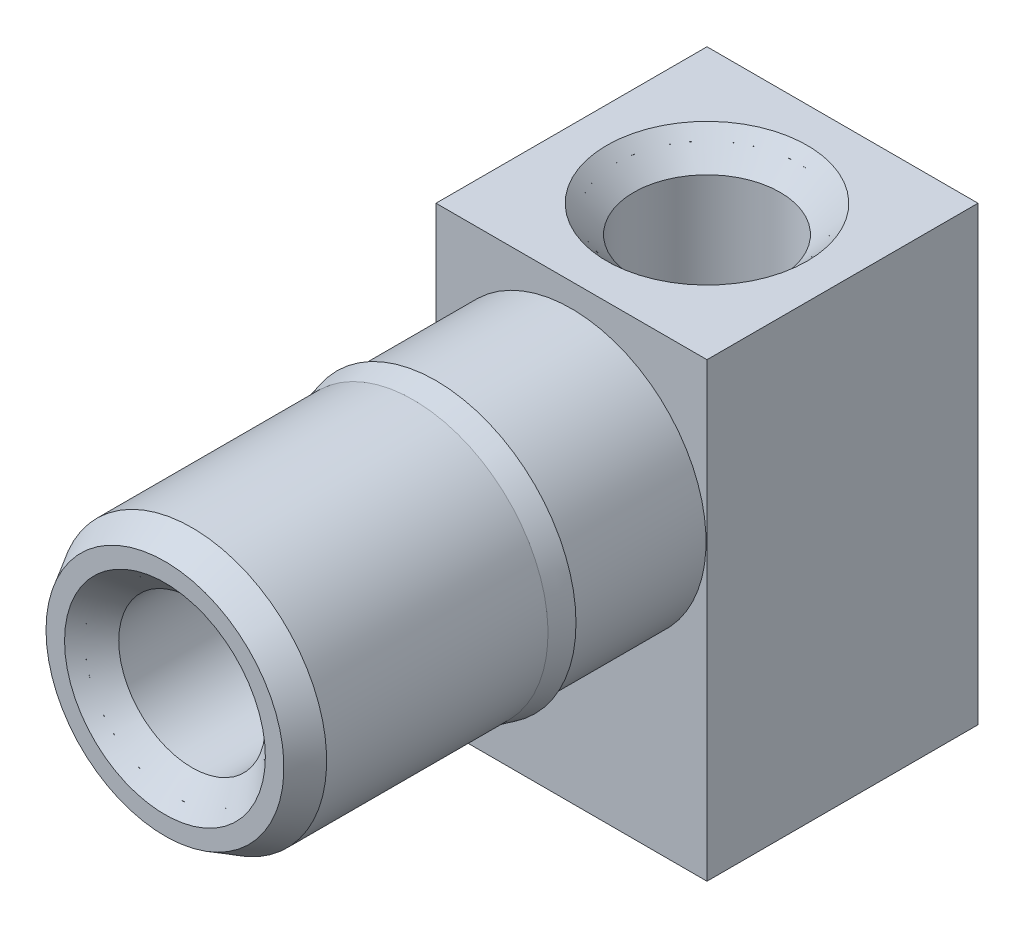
ISO-10303-21;
HEADER;
FILE_DESCRIPTION(('STEP AP214'),'2;1');
FILE_NAME('part.step','',(''),(''),'','','');
FILE_SCHEMA(('AUTOMOTIVE_DESIGN { 1 0 10303 214 1 1 1 1 }'));
ENDSEC;
DATA;
#1=APPLICATION_CONTEXT('core data for automotive mechanical design processes');
#2=APPLICATION_PROTOCOL_DEFINITION('international standard','automotive_design',2000,#1);
#3=PRODUCT_CONTEXT('',#1,'mechanical');
#4=PRODUCT('Part','Part','',(#3));
#5=PRODUCT_RELATED_PRODUCT_CATEGORY('part','',(#4));
#6=PRODUCT_DEFINITION_FORMATION('','',#4);
#7=PRODUCT_DEFINITION_CONTEXT('part definition',#1,'design');
#8=PRODUCT_DEFINITION('design','',#6,#7);
#9=PRODUCT_DEFINITION_SHAPE('','',#8);
#10=(LENGTH_UNIT() NAMED_UNIT(*) SI_UNIT(.MILLI.,.METRE.));
#11=(NAMED_UNIT(*) PLANE_ANGLE_UNIT() SI_UNIT($,.RADIAN.));
#12=(NAMED_UNIT(*) SI_UNIT($,.STERADIAN.) SOLID_ANGLE_UNIT());
#13=UNCERTAINTY_MEASURE_WITH_UNIT(LENGTH_MEASURE(1.E-05),#10,'distance_accuracy_value','');
#14=(GEOMETRIC_REPRESENTATION_CONTEXT(3) GLOBAL_UNCERTAINTY_ASSIGNED_CONTEXT((#13)) GLOBAL_UNIT_ASSIGNED_CONTEXT((#10,
#11,#12)) REPRESENTATION_CONTEXT('',''));
#15=CARTESIAN_POINT('',(0.,0.,0.));
#16=DIRECTION('',(0.,0.,1.));
#17=DIRECTION('',(1.,0.,0.));
#18=AXIS2_PLACEMENT_3D('',#15,#16,#17);
#19=CARTESIAN_POINT('',(0.,0.,0.100000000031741));
#20=DIRECTION('',(0.,0.,1.));
#21=DIRECTION('',(1.,0.,0.));
#22=AXIS2_PLACEMENT_3D('',#19,#20,#21);
#23=CONICAL_SURFACE('',#22,0.811499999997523,1.02974425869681);
#24=CARTESIAN_POINT('',(0.,5.6843418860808E-11,-0.387598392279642));
#25=VERTEX_POINT('',#24);
#26=VERTEX_LOOP('',#25);
#27=FACE_BOUND('',#26,.T.);
#28=CARTESIAN_POINT('',(0.,0.,0.1));
#29=DIRECTION('',(0.,0.,-1.));
#30=DIRECTION('',(-1.,0.,0.));
#31=AXIS2_PLACEMENT_3D('',#28,#29,#30);
#32=CIRCLE('',#31,0.8115);
#33=CARTESIAN_POINT('',(-0.8115,0.,0.1));
#34=VERTEX_POINT('',#33);
#35=EDGE_CURVE('P0_E65',#34,#34,#32,.F.);
#36=ORIENTED_EDGE('',*,*,#35,.T.);
#37=EDGE_LOOP('',(#36));
#38=FACE_BOUND('',#37,.T.);
#39=ADVANCED_FACE('P0_F16',(#27,#38),#23,.F.);
#40=CARTESIAN_POINT('',(0.,0.,4.744379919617));
#41=DIRECTION('',(0.,0.,-1.));
#42=DIRECTION('',(-1.,0.,0.));
#43=AXIS2_PLACEMENT_3D('',#40,#41,#42);
#44=CYLINDRICAL_SURFACE('',#43,0.8115);
#45=ORIENTED_EDGE('',*,*,#35,.F.);
#46=EDGE_LOOP('',(#45));
#47=FACE_BOUND('',#46,.T.);
#48=CARTESIAN_POINT('',(0.,0.,4.1999999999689));
#49=DIRECTION('',(0.,0.,1.));
#50=DIRECTION('',(0.,1.,0.));
#51=AXIS2_PLACEMENT_3D('',#48,#49,#50);
#52=CIRCLE('',#51,0.811499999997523);
#53=CARTESIAN_POINT('',(0.,0.811499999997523,4.1999999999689));
#54=VERTEX_POINT('',#53);
#55=EDGE_CURVE('P0_E67',#54,#54,#52,.T.);
#56=ORIENTED_EDGE('',*,*,#55,.T.);
#57=EDGE_LOOP('',(#56));
#58=FACE_BOUND('',#57,.T.);
#59=ADVANCED_FACE('P0_F62',(#47,#58),#44,.F.);
#60=CARTESIAN_POINT('',(0.,0.,4.50000000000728));
#61=DIRECTION('',(0.,0.,1.));
#62=DIRECTION('',(1.,0.,0.));
#63=AXIS2_PLACEMENT_3D('',#60,#61,#62);
#64=CONICAL_SURFACE('',#63,1.1115000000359,0.785398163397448);
#65=ORIENTED_EDGE('',*,*,#55,.F.);
#66=EDGE_LOOP('',(#65));
#67=FACE_BOUND('',#66,.T.);
#68=CARTESIAN_POINT('',(0.,0.,4.50000000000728));
#69=DIRECTION('',(0.,0.,1.));
#70=DIRECTION('',(1.,0.,0.));
#71=AXIS2_PLACEMENT_3D('',#68,#69,#70);
#72=CIRCLE('',#71,1.1115000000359);
#73=CARTESIAN_POINT('',(1.1115000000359,0.,4.50000000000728));
#74=VERTEX_POINT('',#73);
#75=EDGE_CURVE('P0_E19',#74,#74,#72,.T.);
#76=ORIENTED_EDGE('',*,*,#75,.T.);
#77=EDGE_LOOP('',(#76));
#78=FACE_BOUND('',#77,.T.);
#79=ADVANCED_FACE('P0_F102',(#67,#78),#64,.F.);
#80=CARTESIAN_POINT('',(0.,0.,4.5));
#81=DIRECTION('',(0.,0.,-1.));
#82=DIRECTION('',(-1.,0.,0.));
#83=AXIS2_PLACEMENT_3D('',#80,#81,#82);
#84=PLANE('',#83);
#85=ORIENTED_EDGE('',*,*,#75,.F.);
#86=EDGE_LOOP('',(#85));
#87=FACE_BOUND('',#86,.T.);
#88=CARTESIAN_POINT('',(0.,0.,4.49999999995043));
#89=DIRECTION('',(0.,0.,-1.));
#90=DIRECTION('',(-1.,0.,0.));
#91=AXIS2_PLACEMENT_3D('',#88,#89,#90);
#92=CIRCLE('',#91,1.31679491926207);
#93=CARTESIAN_POINT('',(-1.31679491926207,0.,4.49999999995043));
#94=VERTEX_POINT('',#93);
#95=EDGE_CURVE('P0_E93',#94,#94,#92,.T.);
#96=ORIENTED_EDGE('',*,*,#95,.F.);
#97=EDGE_LOOP('',(#96));
#98=FACE_BOUND('',#97,.T.);
#99=ADVANCED_FACE('P0_F104',(#87,#98),#84,.F.);
#100=CARTESIAN_POINT('',(0.,0.,4.20000000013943));
#101=DIRECTION('',(0.,0.,-1.));
#102=DIRECTION('',(-1.,0.,0.));
#103=AXIS2_PLACEMENT_3D('',#100,#101,#102);
#104=CONICAL_SURFACE('',#103,1.48999999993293,0.523598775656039);
#105=CARTESIAN_POINT('',(0.,0.,4.2));
#106=DIRECTION('',(0.,0.,-1.));
#107=DIRECTION('',(-1.,0.,0.));
#108=AXIS2_PLACEMENT_3D('',#105,#106,#107);
#109=CIRCLE('',#108,1.49);
#110=CARTESIAN_POINT('',(-1.49,0.,4.2));
#111=VERTEX_POINT('',#110);
#112=EDGE_CURVE('P0_E95',#111,#111,#109,.T.);
#113=ORIENTED_EDGE('',*,*,#112,.F.);
#114=EDGE_LOOP('',(#113));
#115=FACE_BOUND('',#114,.T.);
#116=ORIENTED_EDGE('',*,*,#95,.T.);
#117=EDGE_LOOP('',(#116));
#118=FACE_BOUND('',#117,.T.);
#119=ADVANCED_FACE('P0_F107',(#115,#118),#104,.T.);
#120=CARTESIAN_POINT('',(0.,0.,4.725));
#121=DIRECTION('',(0.,0.,-1.));
#122=DIRECTION('',(-1.,0.,0.));
#123=AXIS2_PLACEMENT_3D('',#120,#121,#122);
#124=CYLINDRICAL_SURFACE('',#123,1.49);
#125=ORIENTED_EDGE('',*,*,#112,.T.);
#126=EDGE_LOOP('',(#125));
#127=FACE_BOUND('',#126,.T.);
#128=CARTESIAN_POINT('',(0.,0.,1.75000000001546));
#129=DIRECTION('',(0.,0.,-1.));
#130=DIRECTION('',(0.,-1.,0.));
#131=AXIS2_PLACEMENT_3D('',#128,#129,#130);
#132=CIRCLE('',#131,1.4900000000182);
#133=CARTESIAN_POINT('',(0.,-1.4900000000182,1.75000000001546));
#134=VERTEX_POINT('',#133);
#135=EDGE_CURVE('P0_E92',#134,#134,#132,.T.);
#136=ORIENTED_EDGE('',*,*,#135,.F.);
#137=EDGE_LOOP('',(#136));
#138=FACE_BOUND('',#137,.T.);
#139=ADVANCED_FACE('P0_F114',(#127,#138),#124,.T.);
#140=CARTESIAN_POINT('',(0.,0.,1.50000000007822));
#141=DIRECTION('',(0.,0.,-1.));
#142=DIRECTION('',(-1.,0.,0.));
#143=AXIS2_PLACEMENT_3D('',#140,#141,#142);
#144=CONICAL_SURFACE('',#143,1.54999999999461,0.235544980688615);
#145=CARTESIAN_POINT('',(0.,0.,1.49999999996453));
#146=DIRECTION('',(0.,0.,-1.));
#147=DIRECTION('',(-1.,0.,0.));
#148=AXIS2_PLACEMENT_3D('',#145,#146,#147);
#149=CIRCLE('',#148,1.5500000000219);
#150=CARTESIAN_POINT('',(-1.5500000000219,0.,1.49999999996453));
#151=VERTEX_POINT('',#150);
#152=EDGE_CURVE('P0_E90',#151,#151,#149,.T.);
#153=ORIENTED_EDGE('',*,*,#152,.F.);
#154=EDGE_LOOP('',(#153));
#155=FACE_BOUND('',#154,.T.);
#156=ORIENTED_EDGE('',*,*,#135,.T.);
#157=EDGE_LOOP('',(#156));
#158=FACE_BOUND('',#157,.T.);
#159=ADVANCED_FACE('P0_F166',(#155,#158),#144,.T.);
#160=CARTESIAN_POINT('',(0.,0.,1.5));
#161=DIRECTION('',(0.,0.,-1.));
#162=DIRECTION('',(-1.,0.,0.));
#163=AXIS2_PLACEMENT_3D('',#160,#161,#162);
#164=PLANE('',#163);
#165=CARTESIAN_POINT('',(0.,0.,1.5));
#166=DIRECTION('',(0.,0.,-1.));
#167=DIRECTION('',(-1.,0.,0.));
#168=AXIS2_PLACEMENT_3D('',#165,#166,#167);
#169=CIRCLE('',#168,1.49);
#170=CARTESIAN_POINT('',(-1.49,0.,1.5));
#171=VERTEX_POINT('',#170);
#172=EDGE_CURVE('P0_E86',#171,#171,#169,.T.);
#173=ORIENTED_EDGE('',*,*,#172,.F.);
#174=EDGE_LOOP('',(#173));
#175=FACE_BOUND('',#174,.T.);
#176=ORIENTED_EDGE('',*,*,#152,.T.);
#177=EDGE_LOOP('',(#176));
#178=FACE_BOUND('',#177,.T.);
#179=ADVANCED_FACE('P0_F162',(#175,#178),#164,.T.);
#180=CARTESIAN_POINT('',(0.,-3.25,-1.5));
#181=DIRECTION('',(0.,1.,0.));
#182=DIRECTION('',(0.,0.,1.));
#183=AXIS2_PLACEMENT_3D('',#180,#181,#182);
#184=CYLINDRICAL_SURFACE('',#183,0.81);
#185=CARTESIAN_POINT('',(0.,-2.94999999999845,-1.5));
#186=DIRECTION('',(0.,-1.,0.));
#187=DIRECTION('',(1.,0.,0.));
#188=AXIS2_PLACEMENT_3D('',#185,#186,#187);
#189=CIRCLE('',#188,0.81000000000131);
#190=CARTESIAN_POINT('',(0.81000000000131,-2.94999999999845,-1.5));
#191=VERTEX_POINT('',#190);
#192=EDGE_CURVE('P0_E89',#191,#191,#189,.T.);
#193=ORIENTED_EDGE('',*,*,#192,.T.);
#194=EDGE_LOOP('',(#193));
#195=FACE_BOUND('',#194,.T.);
#196=CARTESIAN_POINT('',(0.,1.44999996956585,-1.5));
#197=DIRECTION('',(0.,1.,0.));
#198=DIRECTION('',(0.,0.,-1.));
#199=AXIS2_PLACEMENT_3D('',#196,#197,#198);
#200=CIRCLE('',#199,0.810000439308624);
#201=CARTESIAN_POINT('',(0.,1.44999996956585,-2.31000043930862));
#202=VERTEX_POINT('',#201);
#203=EDGE_CURVE('P0_E184',#202,#202,#200,.T.);
#204=ORIENTED_EDGE('',*,*,#203,.T.);
#205=EDGE_LOOP('',(#204));
#206=FACE_BOUND('',#205,.T.);
#207=ADVANCED_FACE('P0_F158',(#195,#206),#184,.F.);
#208=CARTESIAN_POINT('',(0.,0.,4.725));
#209=DIRECTION('',(0.,0.,-1.));
#210=DIRECTION('',(-1.,0.,0.));
#211=AXIS2_PLACEMENT_3D('',#208,#209,#210);
#212=CYLINDRICAL_SURFACE('',#211,1.49);
#213=CARTESIAN_POINT('',(0.,0.,0.));
#214=DIRECTION('',(0.,0.,-1.));
#215=DIRECTION('',(-1.,0.,0.));
#216=AXIS2_PLACEMENT_3D('',#213,#214,#215);
#217=CIRCLE('',#216,1.49);
#218=CARTESIAN_POINT('',(-1.49,0.,0.));
#219=VERTEX_POINT('',#218);
#220=EDGE_CURVE('P0_E82',#219,#219,#217,.T.);
#221=ORIENTED_EDGE('',*,*,#220,.F.);
#222=EDGE_LOOP('',(#221));
#223=FACE_BOUND('',#222,.T.);
#224=ORIENTED_EDGE('',*,*,#172,.T.);
#225=EDGE_LOOP('',(#224));
#226=FACE_BOUND('',#225,.T.);
#227=ADVANCED_FACE('P0_F154',(#223,#226),#212,.T.);
#228=CARTESIAN_POINT('',(0.,-3.24999999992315,-1.5));
#229=DIRECTION('',(0.,-1.,0.));
#230=DIRECTION('',(0.,0.,-1.));
#231=AXIS2_PLACEMENT_3D('',#228,#229,#230);
#232=CONICAL_SURFACE('',#231,1.109999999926,0.785398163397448);
#233=ORIENTED_EDGE('',*,*,#192,.F.);
#234=EDGE_LOOP('',(#233));
#235=FACE_BOUND('',#234,.T.);
#236=CARTESIAN_POINT('',(0.,-3.24999999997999,-1.5));
#237=DIRECTION('',(0.,-1.,0.));
#238=DIRECTION('',(0.,0.,-1.));
#239=AXIS2_PLACEMENT_3D('',#236,#237,#238);
#240=CIRCLE('',#239,1.10999999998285);
#241=CARTESIAN_POINT('',(0.,-3.24999999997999,-2.60999999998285));
#242=VERTEX_POINT('',#241);
#243=EDGE_CURVE('P0_E77',#242,#242,#240,.F.);
#244=ORIENTED_EDGE('',*,*,#243,.F.);
#245=EDGE_LOOP('',(#244));
#246=FACE_BOUND('',#245,.T.);
#247=ADVANCED_FACE('P0_F150',(#235,#246),#232,.F.);
#248=CARTESIAN_POINT('',(1.5,0.,0.));
#249=DIRECTION('',(1.,0.,0.));
#250=DIRECTION('',(0.,0.,-1.));
#251=AXIS2_PLACEMENT_3D('',#248,#249,#250);
#252=PLANE('',#251);
#253=DIRECTION('',(0.,0.,1.));
#254=VECTOR('',#253,1.);
#255=CARTESIAN_POINT('',(1.5,1.75,-3.));
#256=LINE('',#255,#254);
#257=CARTESIAN_POINT('',(1.5,1.75,0.));
#258=VERTEX_POINT('',#257);
#259=CARTESIAN_POINT('',(1.5,1.75,-3.));
#260=VERTEX_POINT('',#259);
#261=EDGE_CURVE('P0_E196',#258,#260,#256,.F.);
#262=ORIENTED_EDGE('',*,*,#261,.F.);
#263=DIRECTION('',(0.,1.,0.));
#264=VECTOR('',#263,1.);
#265=CARTESIAN_POINT('',(1.5,1.75,0.));
#266=LINE('',#265,#264);
#267=CARTESIAN_POINT('',(1.5,-3.25,0.));
#268=VERTEX_POINT('',#267);
#269=EDGE_CURVE('P0_E85',#268,#258,#266,.T.);
#270=ORIENTED_EDGE('',*,*,#269,.F.);
#271=DIRECTION('',(0.,0.,-1.));
#272=VECTOR('',#271,1.);
#273=CARTESIAN_POINT('',(1.5,-3.25,0.));
#274=LINE('',#273,#272);
#275=CARTESIAN_POINT('',(1.5,-3.25,-3.));
#276=VERTEX_POINT('',#275);
#277=EDGE_CURVE('P0_E56',#276,#268,#274,.F.);
#278=ORIENTED_EDGE('',*,*,#277,.F.);
#279=DIRECTION('',(0.,1.,0.));
#280=VECTOR('',#279,1.);
#281=CARTESIAN_POINT('',(1.5,-3.25,-3.));
#282=LINE('',#281,#280);
#283=EDGE_CURVE('P0_E80',#260,#276,#282,.F.);
#284=ORIENTED_EDGE('',*,*,#283,.F.);
#285=EDGE_LOOP('',(#262,#270,#278,#284));
#286=FACE_BOUND('',#285,.T.);
#287=ADVANCED_FACE('P0_F146',(#286),#252,.T.);
#288=CARTESIAN_POINT('',(0.,1.74999940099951,-1.5));
#289=DIRECTION('',(0.,1.,0.));
#290=DIRECTION('',(-1.,0.,0.));
#291=AXIS2_PLACEMENT_3D('',#288,#289,#290);
#292=CONICAL_SURFACE('',#291,1.11000004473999,0.78539845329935);
#293=ORIENTED_EDGE('',*,*,#203,.F.);
#294=EDGE_LOOP('',(#293));
#295=FACE_BOUND('',#294,.T.);
#296=CARTESIAN_POINT('',(0.,1.74999940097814,-1.5));
#297=DIRECTION('',(0.,1.,0.));
#298=DIRECTION('',(-1.,0.,0.));
#299=AXIS2_PLACEMENT_3D('',#296,#297,#298);
#300=CIRCLE('',#299,1.11000004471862);
#301=CARTESIAN_POINT('',(-1.11000004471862,1.74999940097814,-1.5));
#302=VERTEX_POINT('',#301);
#303=EDGE_CURVE('P0_E73',#302,#302,#300,.F.);
#304=ORIENTED_EDGE('',*,*,#303,.F.);
#305=EDGE_LOOP('',(#304));
#306=FACE_BOUND('',#305,.T.);
#307=ADVANCED_FACE('P0_F142',(#295,#306),#292,.F.);
#308=CARTESIAN_POINT('',(-1.5,1.75,0.));
#309=DIRECTION('',(0.,0.,1.));
#310=DIRECTION('',(1.,0.,0.));
#311=AXIS2_PLACEMENT_3D('',#308,#309,#310);
#312=PLANE('',#311);
#313=ORIENTED_EDGE('',*,*,#220,.T.);
#314=EDGE_LOOP('',(#313));
#315=FACE_BOUND('',#314,.T.);
#316=DIRECTION('',(1.,0.,0.));
#317=VECTOR('',#316,1.);
#318=CARTESIAN_POINT('',(-1.5,1.75,0.));
#319=LINE('',#318,#317);
#320=CARTESIAN_POINT('',(-1.5,1.75,0.));
#321=VERTEX_POINT('',#320);
#322=EDGE_CURVE('P0_E193',#321,#258,#319,.T.);
#323=ORIENTED_EDGE('',*,*,#322,.F.);
#324=DIRECTION('',(0.,1.,0.));
#325=VECTOR('',#324,1.);
#326=CARTESIAN_POINT('',(-1.5,0.,0.));
#327=LINE('',#326,#325);
#328=CARTESIAN_POINT('',(-1.5,-3.25,0.));
#329=VERTEX_POINT('',#328);
#330=EDGE_CURVE('P0_E76',#321,#329,#327,.F.);
#331=ORIENTED_EDGE('',*,*,#330,.T.);
#332=DIRECTION('',(1.,0.,0.));
#333=VECTOR('',#332,1.);
#334=CARTESIAN_POINT('',(-1.5,-3.25,0.));
#335=LINE('',#334,#333);
#336=EDGE_CURVE('P0_E81',#268,#329,#335,.F.);
#337=ORIENTED_EDGE('',*,*,#336,.F.);
#338=ORIENTED_EDGE('',*,*,#269,.T.);
#339=EDGE_LOOP('',(#323,#331,#337,#338));
#340=FACE_BOUND('',#339,.T.);
#341=ADVANCED_FACE('P0_F138',(#315,#340),#312,.T.);
#342=CARTESIAN_POINT('',(-1.5,-3.25,0.));
#343=DIRECTION('',(0.,-1.,0.));
#344=DIRECTION('',(0.,0.,-1.));
#345=AXIS2_PLACEMENT_3D('',#342,#343,#344);
#346=PLANE('',#345);
#347=ORIENTED_EDGE('',*,*,#243,.T.);
#348=EDGE_LOOP('',(#347));
#349=FACE_BOUND('',#348,.T.);
#350=ORIENTED_EDGE('',*,*,#336,.T.);
#351=DIRECTION('',(0.,0.,-1.));
#352=VECTOR('',#351,1.);
#353=CARTESIAN_POINT('',(-1.5,-3.25,0.));
#354=LINE('',#353,#352);
#355=CARTESIAN_POINT('',(-1.5,-3.25,-3.));
#356=VERTEX_POINT('',#355);
#357=EDGE_CURVE('P0_E201',#329,#356,#354,.T.);
#358=ORIENTED_EDGE('',*,*,#357,.T.);
#359=DIRECTION('',(-1.,0.,0.));
#360=VECTOR('',#359,1.);
#361=CARTESIAN_POINT('',(-1.5,-3.25,-3.));
#362=LINE('',#361,#360);
#363=EDGE_CURVE('P0_E191',#276,#356,#362,.T.);
#364=ORIENTED_EDGE('',*,*,#363,.F.);
#365=ORIENTED_EDGE('',*,*,#277,.T.);
#366=EDGE_LOOP('',(#350,#358,#364,#365));
#367=FACE_BOUND('',#366,.T.);
#368=ADVANCED_FACE('P0_F134',(#349,#367),#346,.T.);
#369=CARTESIAN_POINT('',(-1.5,-3.25,-3.));
#370=DIRECTION('',(0.,0.,-1.));
#371=DIRECTION('',(-1.,0.,0.));
#372=AXIS2_PLACEMENT_3D('',#369,#370,#371);
#373=PLANE('',#372);
#374=ORIENTED_EDGE('',*,*,#363,.T.);
#375=DIRECTION('',(0.,1.,0.));
#376=VECTOR('',#375,1.);
#377=CARTESIAN_POINT('',(-1.5,0.,-3.));
#378=LINE('',#377,#376);
#379=CARTESIAN_POINT('',(-1.5,1.75,-3.));
#380=VERTEX_POINT('',#379);
#381=EDGE_CURVE('P0_E25',#356,#380,#378,.T.);
#382=ORIENTED_EDGE('',*,*,#381,.T.);
#383=DIRECTION('',(1.,0.,0.));
#384=VECTOR('',#383,1.);
#385=CARTESIAN_POINT('',(-1.5,1.75,-3.));
#386=LINE('',#385,#384);
#387=EDGE_CURVE('P0_E33',#260,#380,#386,.F.);
#388=ORIENTED_EDGE('',*,*,#387,.F.);
#389=ORIENTED_EDGE('',*,*,#283,.T.);
#390=EDGE_LOOP('',(#374,#382,#388,#389));
#391=FACE_BOUND('',#390,.T.);
#392=ADVANCED_FACE('P0_F127',(#391),#373,.T.);
#393=CARTESIAN_POINT('',(-1.5,1.75,-3.));
#394=DIRECTION('',(0.,1.,0.));
#395=DIRECTION('',(0.,0.,1.));
#396=AXIS2_PLACEMENT_3D('',#393,#394,#395);
#397=PLANE('',#396);
#398=ORIENTED_EDGE('',*,*,#303,.T.);
#399=EDGE_LOOP('',(#398));
#400=FACE_BOUND('',#399,.T.);
#401=ORIENTED_EDGE('',*,*,#387,.T.);
#402=DIRECTION('',(0.,0.,-1.));
#403=VECTOR('',#402,1.);
#404=CARTESIAN_POINT('',(-1.5,1.75,0.));
#405=LINE('',#404,#403);
#406=EDGE_CURVE('P0_E11',#380,#321,#405,.F.);
#407=ORIENTED_EDGE('',*,*,#406,.T.);
#408=ORIENTED_EDGE('',*,*,#322,.T.);
#409=ORIENTED_EDGE('',*,*,#261,.T.);
#410=EDGE_LOOP('',(#401,#407,#408,#409));
#411=FACE_BOUND('',#410,.T.);
#412=ADVANCED_FACE('P0_F121',(#400,#411),#397,.T.);
#413=CARTESIAN_POINT('',(-1.5,0.,0.));
#414=DIRECTION('',(1.,0.,0.));
#415=DIRECTION('',(0.,0.,-1.));
#416=AXIS2_PLACEMENT_3D('',#413,#414,#415);
#417=PLANE('',#416);
#418=ORIENTED_EDGE('',*,*,#381,.F.);
#419=ORIENTED_EDGE('',*,*,#357,.F.);
#420=ORIENTED_EDGE('',*,*,#330,.F.);
#421=ORIENTED_EDGE('',*,*,#406,.F.);
#422=EDGE_LOOP('',(#418,#419,#420,#421));
#423=FACE_BOUND('',#422,.T.);
#424=ADVANCED_FACE('P0_F119',(#423),#417,.F.);
#425=CLOSED_SHELL('',(#39,#59,#79,#99,#119,#139,#159,#179,#207,#227,#247,#287,#307,#341,#368,
#392,#412,#424));
#426=MANIFOLD_SOLID_BREP('P0_B1',#425);
#427=CARTESIAN_POINT('',(0.,2.250000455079,-1.5));
#428=DIRECTION('',(0.,-1.,0.));
#429=DIRECTION('',(0.,0.,-1.));
#430=AXIS2_PLACEMENT_3D('',#427,#428,#429);
#431=CYLINDRICAL_SURFACE('',#430,1.);
#432=CARTESIAN_POINT('',(0.,-3.14,-1.5));
#433=DIRECTION('',(0.,-1.,0.));
#434=DIRECTION('',(0.,0.,-1.));
#435=AXIS2_PLACEMENT_3D('',#432,#433,#434);
#436=CIRCLE('',#435,1.);
#437=CARTESIAN_POINT('',(0.,-3.14,-2.5));
#438=VERTEX_POINT('',#437);
#439=EDGE_CURVE('P1_E15',#438,#438,#436,.F.);
#440=ORIENTED_EDGE('',*,*,#439,.T.);
#441=EDGE_LOOP('',(#440));
#442=FACE_BOUND('',#441,.T.);
#443=CARTESIAN_POINT('',(0.,1.639999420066,-1.5));
#444=DIRECTION('',(0.,-1.,0.));
#445=DIRECTION('',(0.,0.,-1.));
#446=AXIS2_PLACEMENT_3D('',#443,#444,#445);
#447=CIRCLE('',#446,1.);
#448=CARTESIAN_POINT('',(0.,1.639999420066,-2.5));
#449=VERTEX_POINT('',#448);
#450=EDGE_CURVE('P1_E10',#449,#449,#447,.T.);
#451=ORIENTED_EDGE('',*,*,#450,.T.);
#452=EDGE_LOOP('',(#451));
#453=FACE_BOUND('',#452,.T.);
#454=ADVANCED_FACE('P1_F14',(#442,#453),#431,.T.);
#455=OPEN_SHELL('',(#454));
#456=SHELL_BASED_SURFACE_MODEL('P1_B1',(#455));
#457=CARTESIAN_POINT('',(0.,0.,5.25));
#458=DIRECTION('',(0.,0.,-1.));
#459=DIRECTION('',(-1.,0.,0.));
#460=AXIS2_PLACEMENT_3D('',#457,#458,#459);
#461=CYLINDRICAL_SURFACE('',#460,1.);
#462=CARTESIAN_POINT('',(0.,0.,1.));
#463=DIRECTION('',(0.,0.,-1.));
#464=DIRECTION('',(-1.,0.,0.));
#465=AXIS2_PLACEMENT_3D('',#462,#463,#464);
#466=CIRCLE('',#465,1.);
#467=CARTESIAN_POINT('',(-1.,0.,1.));
#468=VERTEX_POINT('',#467);
#469=EDGE_CURVE('P2_E11',#468,#468,#466,.F.);
#470=ORIENTED_EDGE('',*,*,#469,.T.);
#471=EDGE_LOOP('',(#470));
#472=FACE_BOUND('',#471,.T.);
#473=CARTESIAN_POINT('',(0.,0.,4.3885));
#474=DIRECTION('',(0.,0.,-1.));
#475=DIRECTION('',(-1.,0.,0.));
#476=AXIS2_PLACEMENT_3D('',#473,#474,#475);
#477=CIRCLE('',#476,1.);
#478=CARTESIAN_POINT('',(-1.,0.,4.3885));
#479=VERTEX_POINT('',#478);
#480=EDGE_CURVE('P2_E23',#479,#479,#477,.T.);
#481=ORIENTED_EDGE('',*,*,#480,.T.);
#482=EDGE_LOOP('',(#481));
#483=FACE_BOUND('',#482,.T.);
#484=ADVANCED_FACE('P2_F16',(#472,#483),#461,.T.);
#485=CARTESIAN_POINT('',(0.,0.,1.));
#486=DIRECTION('',(0.,0.,1.));
#487=DIRECTION('',(1.,0.,0.));
#488=AXIS2_PLACEMENT_3D('',#485,#486,#487);
#489=PLANE('',#488);
#490=CARTESIAN_POINT('',(-0.8115,0.,1.));
#491=CARTESIAN_POINT('',(-0.811297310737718,0.155033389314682,1.));
#492=CARTESIAN_POINT('',(-0.754523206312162,0.29870885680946,1.));
#493=CARTESIAN_POINT('',(-0.69295201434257,0.454524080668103,1.));
#494=CARTESIAN_POINT('',(-0.573817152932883,0.573817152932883,1.));
#495=CARTESIAN_POINT('',(-0.455426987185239,0.692364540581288,1.));
#496=CARTESIAN_POINT('',(-0.29870885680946,0.754523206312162,1.));
#497=CARTESIAN_POINT('',(-0.155311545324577,0.811398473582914,1.));
#498=CARTESIAN_POINT('',(0.,0.8115,1.));
#499=CARTESIAN_POINT('',(0.154265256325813,0.811600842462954,1.));
#500=CARTESIAN_POINT('',(0.29870885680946,0.754523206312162,1.));
#501=CARTESIAN_POINT('',(0.454524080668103,0.69295201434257,1.));
#502=CARTESIAN_POINT('',(0.573817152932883,0.573817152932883,1.));
#503=CARTESIAN_POINT('',(0.692364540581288,0.455426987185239,1.));
#504=CARTESIAN_POINT('',(0.754523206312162,0.29870885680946,1.));
#505=CARTESIAN_POINT('',(0.811296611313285,0.155568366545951,1.));
#506=CARTESIAN_POINT('',(0.8115,0.,1.));
#507=B_SPLINE_CURVE_WITH_KNOTS('',2,(#490,#491,#492,#493,#494,#495,#496,#497,#498,#499,#500,
#501,#502,#503,#504,#505,#506),.UNSPECIFIED.,.F.,.F.,(3,2,2,2,2,2,2,2,3),(0.,0.125,0.25,0.375,
0.5,0.625,0.75,0.875,1.),.UNSPECIFIED.);
#508=CARTESIAN_POINT('',(-0.8115,0.,1.));
#509=VERTEX_POINT('',#508);
#510=CARTESIAN_POINT('',(0.8115,0.,1.));
#511=VERTEX_POINT('',#510);
#512=EDGE_CURVE('P2_E27',#509,#511,#507,.T.);
#513=ORIENTED_EDGE('',*,*,#512,.F.);
#514=CARTESIAN_POINT('',(0.8115,0.,1.));
#515=CARTESIAN_POINT('',(0.811297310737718,-0.155033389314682,1.));
#516=CARTESIAN_POINT('',(0.754523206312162,-0.29870885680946,1.));
#517=CARTESIAN_POINT('',(0.69295201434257,-0.454524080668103,1.));
#518=CARTESIAN_POINT('',(0.573817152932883,-0.573817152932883,1.));
#519=CARTESIAN_POINT('',(0.455426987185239,-0.692364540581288,1.));
#520=CARTESIAN_POINT('',(0.29870885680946,-0.754523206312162,1.));
#521=CARTESIAN_POINT('',(0.155311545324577,-0.811398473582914,1.));
#522=CARTESIAN_POINT('',(0.,-0.8115,1.));
#523=CARTESIAN_POINT('',(-0.154265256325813,-0.811600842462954,1.));
#524=CARTESIAN_POINT('',(-0.29870885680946,-0.754523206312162,1.));
#525=CARTESIAN_POINT('',(-0.454524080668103,-0.69295201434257,1.));
#526=CARTESIAN_POINT('',(-0.573817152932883,-0.573817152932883,1.));
#527=CARTESIAN_POINT('',(-0.692364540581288,-0.455426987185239,1.));
#528=CARTESIAN_POINT('',(-0.754523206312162,-0.29870885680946,1.));
#529=CARTESIAN_POINT('',(-0.811296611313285,-0.155568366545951,1.));
#530=CARTESIAN_POINT('',(-0.8115,0.,1.));
#531=B_SPLINE_CURVE_WITH_KNOTS('',2,(#514,#515,#516,#517,#518,#519,#520,#521,#522,#523,#524,
#525,#526,#527,#528,#529,#530),.UNSPECIFIED.,.F.,.F.,(3,2,2,2,2,2,2,2,3),(0.,0.125,0.25,0.375,
0.5,0.625,0.75,0.875,1.),.UNSPECIFIED.);
#532=EDGE_CURVE('P2_E32',#511,#509,#531,.T.);
#533=ORIENTED_EDGE('',*,*,#532,.F.);
#534=EDGE_LOOP('',(#513,#533));
#535=FACE_BOUND('',#534,.T.);
#536=ORIENTED_EDGE('',*,*,#469,.F.);
#537=EDGE_LOOP('',(#536));
#538=FACE_BOUND('',#537,.T.);
#539=ADVANCED_FACE('P2_F17',(#535,#538),#489,.F.);
#540=OPEN_SHELL('',(#484,#539));
#541=SHELL_BASED_SURFACE_MODEL('P2_B1',(#540));
#542=ADVANCED_BREP_SHAPE_REPRESENTATION('',(#18,#426),#14);
#543=MANIFOLD_SURFACE_SHAPE_REPRESENTATION('',(#18,#456,#541),#14);
#544=SHAPE_REPRESENTATION('',(#18),#14);
#545=SHAPE_DEFINITION_REPRESENTATION(#9,#544);
#546=SHAPE_REPRESENTATION_RELATIONSHIP('','',#544,#542);
#547=SHAPE_REPRESENTATION_RELATIONSHIP('','',#544,#543);
ENDSEC;
END-ISO-10303-21;
